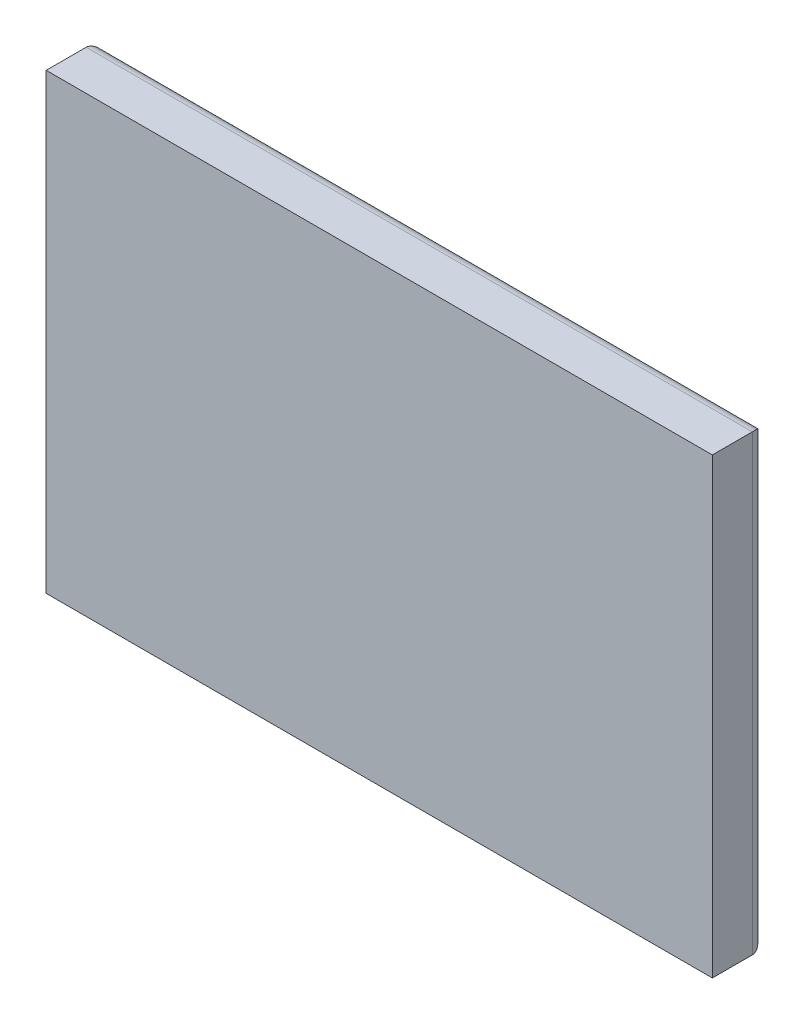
from build123d import *

# Parameters (mm, degrees)
SKETCH1_W           = 31.75
SKETCH1_H           = 21.59
BOSS_EXTRUDE1_DEPTH = 2.54
FILLET1_R           = 0.635
SKETCH3_W           = 29.21
SKETCH3_H           = 19.05
CUT_EXTRUDE1_DEPTH  = 1.905


with BuildPart() as part:
    # Sketch1 → Boss-Extrude1 (new body)
    with BuildSketch(Plane.XY):
        Rectangle(SKETCH1_W, SKETCH1_H)
    extrude(amount=BOSS_EXTRUDE1_DEPTH)

    # Fillet1
    fillet1_edges = [part.edges().sort_by_distance(p)[0] for p in [
        (0, -10.795, 0),
        (-15.875, 0, 0),
        (0, 10.795, 0),
        (15.875, 0, 0),
    ]]
    fillet(fillet1_edges, radius=FILLET1_R)

    # Sketch3 → Cut-Extrude1 (cut)
    with BuildSketch(Plane(origin=(0, 0, 0), x_dir=(-1, 0, 0), z_dir=(0, 0, -1))):
        Rectangle(SKETCH3_W, SKETCH3_H)
    extrude(amount=-CUT_EXTRUDE1_DEPTH, mode=Mode.SUBTRACT)


solid = part.part
